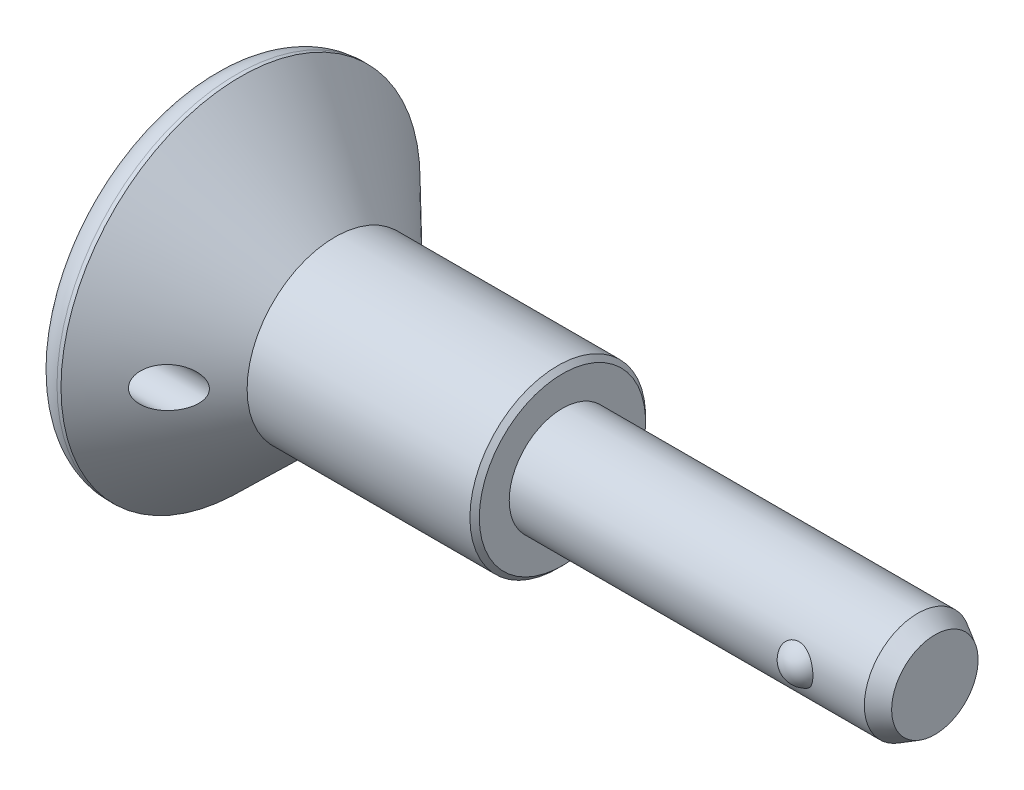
ISO-10303-21;
HEADER;
FILE_DESCRIPTION(('STEP AP214'),'2;1');
FILE_NAME('part.step','',(''),(''),'','','');
FILE_SCHEMA(('AUTOMOTIVE_DESIGN { 1 0 10303 214 1 1 1 1 }'));
ENDSEC;
DATA;
#1=APPLICATION_CONTEXT('core data for automotive mechanical design processes');
#2=APPLICATION_PROTOCOL_DEFINITION('international standard','automotive_design',2000,#1);
#3=PRODUCT_CONTEXT('',#1,'mechanical');
#4=PRODUCT('Part','Part','',(#3));
#5=PRODUCT_RELATED_PRODUCT_CATEGORY('part','',(#4));
#6=PRODUCT_DEFINITION_FORMATION('','',#4);
#7=PRODUCT_DEFINITION_CONTEXT('part definition',#1,'design');
#8=PRODUCT_DEFINITION('design','',#6,#7);
#9=PRODUCT_DEFINITION_SHAPE('','',#8);
#10=(LENGTH_UNIT() NAMED_UNIT(*) SI_UNIT(.MILLI.,.METRE.));
#11=(NAMED_UNIT(*) PLANE_ANGLE_UNIT() SI_UNIT($,.RADIAN.));
#12=(NAMED_UNIT(*) SI_UNIT($,.STERADIAN.) SOLID_ANGLE_UNIT());
#13=UNCERTAINTY_MEASURE_WITH_UNIT(LENGTH_MEASURE(1.E-05),#10,'distance_accuracy_value','');
#14=(GEOMETRIC_REPRESENTATION_CONTEXT(3) GLOBAL_UNCERTAINTY_ASSIGNED_CONTEXT((#13)) GLOBAL_UNIT_ASSIGNED_CONTEXT((#10,
#11,#12)) REPRESENTATION_CONTEXT('',''));
#15=CARTESIAN_POINT('',(0.,0.,0.));
#16=DIRECTION('',(0.,0.,1.));
#17=DIRECTION('',(1.,0.,0.));
#18=AXIS2_PLACEMENT_3D('',#15,#16,#17);
#19=CARTESIAN_POINT('',(26.5,0.,0.));
#20=DIRECTION('',(-1.,0.,0.));
#21=DIRECTION('',(0.,0.,1.));
#22=AXIS2_PLACEMENT_3D('',#19,#20,#21);
#23=PLANE('',#22);
#24=CARTESIAN_POINT('',(26.5,0.,0.));
#25=DIRECTION('',(-1.,0.,0.));
#26=DIRECTION('',(0.,0.,1.));
#27=AXIS2_PLACEMENT_3D('',#24,#25,#26);
#28=CIRCLE('',#27,6.25);
#29=CARTESIAN_POINT('',(26.5,0.,6.25));
#30=VERTEX_POINT('',#29);
#31=EDGE_CURVE('E156',#30,#30,#28,.T.);
#32=ORIENTED_EDGE('',*,*,#31,.F.);
#33=EDGE_LOOP('',(#32));
#34=FACE_BOUND('',#33,.T.);
#35=CARTESIAN_POINT('',(26.5,0.,0.));
#36=DIRECTION('',(-1.,0.,0.));
#37=DIRECTION('',(0.,0.,1.));
#38=AXIS2_PLACEMENT_3D('',#35,#36,#37);
#39=CIRCLE('',#38,4.);
#40=CARTESIAN_POINT('',(26.5,0.,4.));
#41=VERTEX_POINT('',#40);
#42=EDGE_CURVE('E11',#41,#41,#39,.F.);
#43=ORIENTED_EDGE('',*,*,#42,.F.);
#44=EDGE_LOOP('',(#43));
#45=FACE_BOUND('',#44,.T.);
#46=ADVANCED_FACE('F16',(#34,#45),#23,.F.);
#47=CARTESIAN_POINT('',(0.,0.,0.));
#48=DIRECTION('',(-1.,0.,0.));
#49=DIRECTION('',(0.,0.,1.));
#50=AXIS2_PLACEMENT_3D('',#47,#48,#49);
#51=PLANE('',#50);
#52=CARTESIAN_POINT('',(0.,0.,0.));
#53=DIRECTION('',(-1.,0.,0.));
#54=DIRECTION('',(0.,0.,1.));
#55=AXIS2_PLACEMENT_3D('',#52,#53,#54);
#56=CIRCLE('',#55,11.5);
#57=CARTESIAN_POINT('',(0.,0.,11.5));
#58=VERTEX_POINT('',#57);
#59=EDGE_CURVE('E160',#58,#58,#56,.T.);
#60=ORIENTED_EDGE('',*,*,#59,.T.);
#61=EDGE_LOOP('',(#60));
#62=FACE_BOUND('',#61,.T.);
#63=CARTESIAN_POINT('',(0.,0.,9.5));
#64=DIRECTION('',(-1.,0.,0.));
#65=DIRECTION('',(0.,0.,1.));
#66=AXIS2_PLACEMENT_3D('',#63,#64,#65);
#67=CIRCLE('',#66,1.5);
#68=CARTESIAN_POINT('',(0.,-1.44712916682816,9.89473684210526));
#69=VERTEX_POINT('',#68);
#70=CARTESIAN_POINT('',(0.,1.44712916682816,9.89473684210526));
#71=VERTEX_POINT('',#70);
#72=EDGE_CURVE('E48',#69,#71,#67,.T.);
#73=ORIENTED_EDGE('',*,*,#72,.F.);
#74=CARTESIAN_POINT('',(0.,0.,0.));
#75=DIRECTION('',(-1.,0.,0.));
#76=DIRECTION('',(0.,0.,1.));
#77=AXIS2_PLACEMENT_3D('',#74,#75,#76);
#78=CIRCLE('',#77,10.);
#79=EDGE_CURVE('E37',#71,#69,#78,.T.);
#80=ORIENTED_EDGE('',*,*,#79,.F.);
#81=EDGE_LOOP('',(#73,#80));
#82=FACE_BOUND('',#81,.T.);
#83=ADVANCED_FACE('F47',(#62,#82),#51,.T.);
#84=CARTESIAN_POINT('',(-1.,0.,9.5));
#85=DIRECTION('',(1.,0.,0.));
#86=DIRECTION('',(0.,-1.,0.));
#87=AXIS2_PLACEMENT_3D('',#84,#85,#86);
#88=CYLINDRICAL_SURFACE('',#87,1.5);
#89=CARTESIAN_POINT('',(5.04893948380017,-0.743081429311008,10.8030080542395));
#90=CARTESIAN_POINT('',(5.02077798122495,-0.688374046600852,10.8342033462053));
#91=CARTESIAN_POINT('',(4.99527839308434,-0.630616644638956,10.862568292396));
#92=CARTESIAN_POINT('',(4.95072736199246,-0.509716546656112,10.912254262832));
#93=CARTESIAN_POINT('',(4.93168139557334,-0.446569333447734,10.9335693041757));
#94=CARTESIAN_POINT('',(4.90103527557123,-0.315899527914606,10.9679201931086));
#95=CARTESIAN_POINT('',(4.8894758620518,-0.24835516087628,10.9809107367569));
#96=CARTESIAN_POINT('',(4.87475650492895,-0.111242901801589,10.9974594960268));
#97=CARTESIAN_POINT('',(4.87159053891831,-0.0416764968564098,11.0010244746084));
#98=CARTESIAN_POINT('',(4.8737861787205,0.0921915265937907,10.9985541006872));
#99=CARTESIAN_POINT('',(4.8785594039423,0.15651689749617,10.9931811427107));
#100=CARTESIAN_POINT('',(4.8952322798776,0.283031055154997,10.9744437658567));
#101=CARTESIAN_POINT('',(4.90713279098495,0.345219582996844,10.9610783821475));
#102=CARTESIAN_POINT('',(4.937416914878,0.466033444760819,10.9271509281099));
#103=CARTESIAN_POINT('',(4.95581197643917,0.524652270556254,10.9065761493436));
#104=CARTESIAN_POINT('',(4.99820556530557,0.637182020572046,10.8593126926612));
#105=CARTESIAN_POINT('',(5.02220667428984,0.691090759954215,10.8326211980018));
#106=CARTESIAN_POINT('',(5.08564757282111,0.814473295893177,10.7623448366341));
#107=CARTESIAN_POINT('',(5.12739722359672,0.881366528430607,10.7163033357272));
#108=CARTESIAN_POINT('',(5.21796830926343,1.00417870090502,10.6170888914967));
#109=CARTESIAN_POINT('',(5.26680344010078,1.06007588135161,10.5639021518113));
#110=CARTESIAN_POINT('',(5.38708699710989,1.17811273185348,10.4338844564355));
#111=CARTESIAN_POINT('',(5.4606097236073,1.23600725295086,10.3551260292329));
#112=CARTESIAN_POINT('',(5.61388931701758,1.33381990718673,10.1927720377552));
#113=CARTESIAN_POINT('',(5.69365466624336,1.37371306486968,10.1091699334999));
#114=CARTESIAN_POINT('',(5.88225404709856,1.4465937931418,9.91388012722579));
#115=CARTESIAN_POINT('',(5.9925282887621,1.47375522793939,9.8014099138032));
#116=CARTESIAN_POINT('',(6.21659489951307,1.50231947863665,9.57671622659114));
#117=CARTESIAN_POINT('',(6.33039113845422,1.50369287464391,9.46449318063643));
#118=CARTESIAN_POINT('',(6.56028424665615,1.48188892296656,9.24173191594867));
#119=CARTESIAN_POINT('',(6.67639134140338,1.45837695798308,9.13123745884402));
#120=CARTESIAN_POINT('',(6.90643421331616,1.38640022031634,8.91626960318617));
#121=CARTESIAN_POINT('',(7.02037191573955,1.33795875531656,8.81179068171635));
#122=CARTESIAN_POINT('',(7.21050009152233,1.23221897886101,8.64053335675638));
#123=CARTESIAN_POINT('',(7.28822257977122,1.18134100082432,8.57147360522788));
#124=CARTESIAN_POINT('',(7.43809723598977,1.06488380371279,8.43994042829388));
#125=CARTESIAN_POINT('',(7.51025846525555,0.999329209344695,8.37745622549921));
#126=CARTESIAN_POINT('',(7.62440104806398,0.874693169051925,8.27970971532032));
#127=CARTESIAN_POINT('',(7.66884300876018,0.819811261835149,8.24198211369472));
#128=CARTESIAN_POINT('',(7.75116410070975,0.701855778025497,8.17257218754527));
#129=CARTESIAN_POINT('',(7.78905330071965,0.638795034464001,8.14088058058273));
#130=CARTESIAN_POINT('',(7.84781829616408,0.520195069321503,8.09198637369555));
#131=CARTESIAN_POINT('',(7.87060209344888,0.466295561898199,8.07312800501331));
#132=CARTESIAN_POINT('',(7.90916133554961,0.354377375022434,8.04130516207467));
#133=CARTESIAN_POINT('',(7.92494314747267,0.29636249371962,8.02833533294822));
#134=CARTESIAN_POINT('',(7.94819747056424,0.177034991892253,8.00925096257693));
#135=CARTESIAN_POINT('',(7.95560071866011,0.115699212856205,8.00319356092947));
#136=CARTESIAN_POINT('',(7.96102625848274,-0.00765741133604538,7.99875257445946));
#137=CARTESIAN_POINT('',(7.95905297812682,-0.0696779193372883,8.00036536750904));
#138=CARTESIAN_POINT('',(7.94678999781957,-0.18447139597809,8.01041020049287));
#139=CARTESIAN_POINT('',(7.93755628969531,-0.237441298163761,8.01797643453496));
#140=CARTESIAN_POINT('',(7.91283968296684,-0.340850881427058,8.03828815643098));
#141=CARTESIAN_POINT('',(7.89735392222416,-0.391289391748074,8.05103601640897));
#142=CARTESIAN_POINT('',(7.85444035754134,-0.506844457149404,8.08649833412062));
#143=CARTESIAN_POINT('',(7.82471445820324,-0.570507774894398,8.11115474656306));
#144=CARTESIAN_POINT('',(7.75797917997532,-0.690811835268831,8.16688402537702));
#145=CARTESIAN_POINT('',(7.72095420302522,-0.747437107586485,8.19797064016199));
#146=CARTESIAN_POINT('',(7.62345524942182,-0.878148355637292,8.28046003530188));
#147=CARTESIAN_POINT('',(7.56003258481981,-0.948273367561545,8.33462769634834));
#148=CARTESIAN_POINT('',(7.42645542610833,-1.07476958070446,8.45013026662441));
#149=CARTESIAN_POINT('',(7.35628757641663,-1.13111267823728,8.51147944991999));
#150=CARTESIAN_POINT('',(7.18051046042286,-1.25296314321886,8.66713887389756));
#151=CARTESIAN_POINT('',(7.07273498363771,-1.31183707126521,8.76419965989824));
#152=CARTESIAN_POINT('',(6.85351984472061,-1.40585361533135,8.96530542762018));
#153=CARTESIAN_POINT('',(6.7420764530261,-1.44097124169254,9.06935763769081));
#154=CARTESIAN_POINT('',(6.51602642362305,-1.48855878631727,9.2842219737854));
#155=CARTESIAN_POINT('',(6.40140432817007,-1.50051076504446,9.39513269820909));
#156=CARTESIAN_POINT('',(6.17418690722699,-1.4994566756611,9.61884504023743));
#157=CARTESIAN_POINT('',(6.06158988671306,-1.48647256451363,9.73164490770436));
#158=CARTESIAN_POINT('',(5.86104301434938,-1.43841086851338,9.93579800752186));
#159=CARTESIAN_POINT('',(5.77228415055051,-1.40769567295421,10.0273818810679));
#160=CARTESIAN_POINT('',(5.60021944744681,-1.32654908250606,10.2070838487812));
#161=CARTESIAN_POINT('',(5.51691012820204,-1.27613041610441,10.2952041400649));
#162=CARTESIAN_POINT('',(5.37856732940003,-1.16906426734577,10.4430967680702));
#163=CARTESIAN_POINT('',(5.3216495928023,-1.11707274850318,10.5044745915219));
#164=CARTESIAN_POINT('',(5.21469929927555,-1.00046945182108,10.6206172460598));
#165=CARTESIAN_POINT('',(5.16464057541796,-0.935908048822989,10.6754071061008));
#166=CARTESIAN_POINT('',(5.0943253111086,-0.826282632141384,10.7528043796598));
#167=CARTESIAN_POINT('',(5.07082832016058,-0.785603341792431,10.7787611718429));
#168=CARTESIAN_POINT('',(5.04893948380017,-0.743081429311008,10.8030080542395));
#169=B_SPLINE_CURVE_WITH_KNOTS('',3,(#89,#90,#91,#92,#93,#94,#95,#96,#97,#98,#99,#100,#101,#102,
#103,#104,#105,#106,#107,#108,#109,#110,#111,#112,#113,#114,#115,#116,#117,#118,#119,#120,#121,
#122,#123,#124,#125,#126,#127,#128,#129,#130,#131,#132,#133,#134,#135,#136,#137,#138,#139,#140,
#141,#142,#143,#144,#145,#146,#147,#148,#149,#150,#151,#152,#153,#154,#155,#156,#157,#158,#159,
#160,#161,#162,#163,#164,#165,#166,#167,#168),.UNSPECIFIED.,.T.,.F.,(4,2,2,2,2,2,2,2,2,2,2,2,2,
2,2,2,2,2,2,2,2,2,2,2,2,2,2,2,2,2,2,2,2,2,2,2,2,2,2,4),(0.,0.206827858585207,0.413830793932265,
0.62195093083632,0.829921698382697,1.0231553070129,1.21641224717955,1.41001158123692,
1.60370024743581,1.87612170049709,2.14907692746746,2.51402398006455,2.87947582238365,
3.35649420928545,3.83405676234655,4.3181233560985,4.80173819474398,5.1480344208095,
5.49375392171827,5.73325221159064,5.97237916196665,6.15613300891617,6.33971941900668,
6.52481264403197,6.70981847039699,6.87200093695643,7.03425773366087,7.25639936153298,
7.47902095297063,7.80411901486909,8.12987458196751,8.59699308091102,9.06460218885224,
9.54255074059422,10.0200786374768,10.4122784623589,10.8042253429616,11.0988406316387,
11.3922986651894,11.5530578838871),.UNSPECIFIED.);
#170=CARTESIAN_POINT('',(5.04893948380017,-0.743081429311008,10.8030080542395));
#171=VERTEX_POINT('',#170);
#172=EDGE_CURVE('E54',#171,#171,#169,.T.);
#173=ORIENTED_EDGE('',*,*,#172,.F.);
#174=EDGE_LOOP('',(#173));
#175=FACE_BOUND('',#174,.T.);
#176=CARTESIAN_POINT('',(-1.99999999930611E-06,-1.44712874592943,9.89473838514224));
#177=CARTESIAN_POINT('',(0.0833519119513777,-1.46463068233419,9.83043715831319));
#178=CARTESIAN_POINT('',(0.166879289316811,-1.47786277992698,9.76518204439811));
#179=CARTESIAN_POINT('',(0.333869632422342,-1.49557590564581,9.63314256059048));
#180=CARTESIAN_POINT('',(0.417332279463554,-1.50004285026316,9.56635590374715));
#181=CARTESIAN_POINT('',(0.584420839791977,-1.49995613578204,9.43110468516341));
#182=CARTESIAN_POINT('',(0.668038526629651,-1.49530312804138,9.36262975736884));
#183=CARTESIAN_POINT('',(0.833813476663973,-1.47627385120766,9.2253869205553));
#184=CARTESIAN_POINT('',(0.915971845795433,-1.46190529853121,9.15661928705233));
#185=CARTESIAN_POINT('',(1.1017504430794,-1.41704524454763,8.99953318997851));
#186=CARTESIAN_POINT('',(1.20467209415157,-1.38308262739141,8.91133843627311));
#187=CARTESIAN_POINT('',(1.40443927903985,-1.29574539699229,8.73815034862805));
#188=CARTESIAN_POINT('',(1.50130514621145,-1.24244034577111,8.65314673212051));
#189=CARTESIAN_POINT('',(1.65892361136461,-1.13234357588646,8.51346528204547));
#190=CARTESIAN_POINT('',(1.72201451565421,-1.08102554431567,8.45713054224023));
#191=CARTESIAN_POINT('',(1.84140074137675,-0.966123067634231,8.34988459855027));
#192=CARTESIAN_POINT('',(1.89770421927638,-0.902553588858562,8.29896689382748));
#193=CARTESIAN_POINT('',(1.9873420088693,-0.780480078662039,8.21751481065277));
#194=CARTESIAN_POINT('',(2.02286540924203,-0.724850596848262,8.18510032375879));
#195=CARTESIAN_POINT('',(2.08684254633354,-0.6066202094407,8.12655715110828));
#196=CARTESIAN_POINT('',(2.11530559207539,-0.544028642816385,8.10042018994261));
#197=CARTESIAN_POINT('',(2.1592670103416,-0.423842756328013,8.05997419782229));
#198=CARTESIAN_POINT('',(2.17614042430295,-0.367176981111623,8.04441547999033));
#199=CARTESIAN_POINT('',(2.20267886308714,-0.250792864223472,8.01992219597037));
#200=CARTESIAN_POINT('',(2.21234848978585,-0.191076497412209,8.01098340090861));
#201=CARTESIAN_POINT('',(2.22379605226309,-0.0700107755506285,8.00039928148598));
#202=CARTESIAN_POINT('',(2.22554467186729,-0.00865619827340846,7.99878105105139));
#203=CARTESIAN_POINT('',(2.22092802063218,0.113480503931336,8.00305086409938));
#204=CARTESIAN_POINT('',(2.21456224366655,0.174262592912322,8.00893937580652));
#205=CARTESIAN_POINT('',(2.1947979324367,0.289985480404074,8.02719746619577));
#206=CARTESIAN_POINT('',(2.18181973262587,0.345061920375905,8.03917961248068));
#207=CARTESIAN_POINT('',(2.14988163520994,0.451893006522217,8.06861312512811));
#208=CARTESIAN_POINT('',(2.1309194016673,0.503646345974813,8.08606662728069));
#209=CARTESIAN_POINT('',(2.07954634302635,0.622490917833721,8.13324166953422));
#210=CARTESIAN_POINT('',(2.04477346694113,0.687715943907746,8.16509432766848));
#211=CARTESIAN_POINT('',(1.96777081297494,0.809689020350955,8.23533292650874));
#212=CARTESIAN_POINT('',(1.92552600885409,0.866419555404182,8.27373202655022));
#213=CARTESIAN_POINT('',(1.81685679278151,0.993223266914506,8.3720193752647));
#214=CARTESIAN_POINT('',(1.74765993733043,1.0591052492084,8.43422523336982));
#215=CARTESIAN_POINT('',(1.60194878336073,1.17548713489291,8.56412621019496));
#216=CARTESIAN_POINT('',(1.52542198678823,1.22596012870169,8.63183067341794));
#217=CARTESIAN_POINT('',(1.38856936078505,1.30144524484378,8.75178350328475));
#218=CARTESIAN_POINT('',(1.32936025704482,1.32965803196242,8.80334308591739));
#219=CARTESIAN_POINT('',(1.20894530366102,1.37920320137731,8.90744365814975));
#220=CARTESIAN_POINT('',(1.14773852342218,1.40053232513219,8.95998510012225));
#221=CARTESIAN_POINT('',(0.961661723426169,1.45497522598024,9.11848108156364));
#222=CARTESIAN_POINT('',(0.834484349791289,1.47846624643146,9.22517614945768));
#223=CARTESIAN_POINT('',(0.647587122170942,1.49591827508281,9.37929750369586));
#224=CARTESIAN_POINT('',(0.588933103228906,1.4989987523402,9.42728983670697));
#225=CARTESIAN_POINT('',(0.471193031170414,1.50058695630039,9.52285460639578));
#226=CARTESIAN_POINT('',(0.412106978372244,1.49909468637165,9.57042704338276));
#227=CARTESIAN_POINT('',(0.294172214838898,1.49168569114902,9.66458960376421));
#228=CARTESIAN_POINT('',(0.235325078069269,1.4858024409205,9.71118443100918));
#229=CARTESIAN_POINT('',(0.117622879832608,1.46970236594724,9.80358866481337));
#230=CARTESIAN_POINT('',(0.0587678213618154,1.45948627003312,9.84939820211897));
#231=CARTESIAN_POINT('',(-1.9999999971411E-06,1.44712874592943,9.89473838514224));
#232=B_SPLINE_CURVE_WITH_KNOTS('',3,(#176,#177,#178,#179,#180,#181,#182,#183,#184,#185,#186,
#187,#188,#189,#190,#191,#192,#193,#194,#195,#196,#197,#198,#199,#200,#201,#202,#203,#204,#205,
#206,#207,#208,#209,#210,#211,#212,#213,#214,#215,#216,#217,#218,#219,#220,#221,#222,#223,#224,
#225,#226,#227,#228,#229,#230,#231),.UNSPECIFIED.,.F.,.F.,(4,2,2,2,2,2,2,2,2,2,2,2,2,2,2,2,2,2,
2,2,2,2,2,2,2,2,2,4),(0.,0.320079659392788,0.640673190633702,0.964778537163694,1.28862677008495,
1.70655145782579,2.12298780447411,2.41890478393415,2.71446253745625,2.93430144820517,
3.15384894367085,3.33649195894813,3.51901819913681,3.70221943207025,3.88543209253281,
4.05823032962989,4.2310961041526,4.47121553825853,4.71182346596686,5.05198338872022,
5.39273399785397,5.64268596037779,5.89275607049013,6.39352928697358,6.62099234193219,
6.84845522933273,7.07420152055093,7.29990985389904),.UNSPECIFIED.);
#233=EDGE_CURVE('E30',#69,#71,#232,.T.);
#234=ORIENTED_EDGE('',*,*,#233,.F.);
#235=ORIENTED_EDGE('',*,*,#72,.T.);
#236=EDGE_LOOP('',(#234,#235));
#237=FACE_BOUND('',#236,.T.);
#238=ADVANCED_FACE('F52',(#175,#237),#88,.F.);
#239=CARTESIAN_POINT('',(0.,0.,0.));
#240=DIRECTION('',(-1.,0.,0.));
#241=DIRECTION('',(0.,0.,1.));
#242=AXIS2_PLACEMENT_3D('',#239,#240,#241);
#243=CYLINDRICAL_SURFACE('',#242,6.60355339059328);
#244=CARTESIAN_POINT('',(9.39644660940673,0.,0.));
#245=DIRECTION('',(-1.,0.,0.));
#246=DIRECTION('',(0.,0.,1.));
#247=AXIS2_PLACEMENT_3D('',#244,#245,#246);
#248=CIRCLE('',#247,6.60355339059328);
#249=CARTESIAN_POINT('',(9.39644660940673,0.,6.60355339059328));
#250=VERTEX_POINT('',#249);
#251=EDGE_CURVE('E44',#250,#250,#248,.T.);
#252=ORIENTED_EDGE('',*,*,#251,.F.);
#253=EDGE_LOOP('',(#252));
#254=FACE_BOUND('',#253,.T.);
#255=CARTESIAN_POINT('',(26.1464466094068,0.,0.));
#256=DIRECTION('',(-1.,0.,0.));
#257=DIRECTION('',(0.,0.,1.));
#258=AXIS2_PLACEMENT_3D('',#255,#256,#257);
#259=CIRCLE('',#258,6.60355339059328);
#260=CARTESIAN_POINT('',(26.1464466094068,0.,6.60355339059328));
#261=VERTEX_POINT('',#260);
#262=EDGE_CURVE('E61',#261,#261,#259,.T.);
#263=ORIENTED_EDGE('',*,*,#262,.T.);
#264=EDGE_LOOP('',(#263));
#265=FACE_BOUND('',#264,.T.);
#266=ADVANCED_FACE('F18',(#254,#265),#243,.T.);
#267=CARTESIAN_POINT('',(9.39644660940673,0.,0.));
#268=DIRECTION('',(-1.,0.,0.));
#269=DIRECTION('',(0.,0.,1.));
#270=AXIS2_PLACEMENT_3D('',#267,#268,#269);
#271=CONICAL_SURFACE('',#270,6.60355339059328,0.771106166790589);
#272=ORIENTED_EDGE('',*,*,#172,.T.);
#273=EDGE_LOOP('',(#272));
#274=FACE_BOUND('',#273,.T.);
#275=CARTESIAN_POINT('',(2.3,0.,0.));
#276=DIRECTION('',(-1.,0.,0.));
#277=DIRECTION('',(0.,0.,1.));
#278=AXIS2_PLACEMENT_3D('',#275,#276,#277);
#279=CIRCLE('',#278,13.5);
#280=CARTESIAN_POINT('',(2.3,0.,13.5));
#281=VERTEX_POINT('',#280);
#282=EDGE_CURVE('E166',#281,#281,#279,.T.);
#283=ORIENTED_EDGE('',*,*,#282,.F.);
#284=EDGE_LOOP('',(#283));
#285=FACE_BOUND('',#284,.T.);
#286=ORIENTED_EDGE('',*,*,#251,.T.);
#287=EDGE_LOOP('',(#286));
#288=FACE_BOUND('',#287,.T.);
#289=ADVANCED_FACE('F144',(#274,#285,#288),#271,.T.);
#290=CARTESIAN_POINT('',(0.,0.,0.));
#291=DIRECTION('',(-1.,0.,0.));
#292=DIRECTION('',(0.,0.,1.));
#293=AXIS2_PLACEMENT_3D('',#290,#291,#292);
#294=CYLINDRICAL_SURFACE('',#293,13.5);
#295=CARTESIAN_POINT('',(2.,0.,0.));
#296=DIRECTION('',(-1.,0.,0.));
#297=DIRECTION('',(0.,0.,1.));
#298=AXIS2_PLACEMENT_3D('',#295,#296,#297);
#299=CIRCLE('',#298,13.5);
#300=CARTESIAN_POINT('',(2.,0.,13.5));
#301=VERTEX_POINT('',#300);
#302=EDGE_CURVE('E163',#301,#301,#299,.T.);
#303=ORIENTED_EDGE('',*,*,#302,.F.);
#304=EDGE_LOOP('',(#303));
#305=FACE_BOUND('',#304,.T.);
#306=ORIENTED_EDGE('',*,*,#282,.T.);
#307=EDGE_LOOP('',(#306));
#308=FACE_BOUND('',#307,.T.);
#309=ADVANCED_FACE('F141',(#305,#308),#294,.T.);
#310=CARTESIAN_POINT('',(2.,0.,0.));
#311=DIRECTION('',(-1.,0.,0.));
#312=DIRECTION('',(0.,0.,1.));
#313=AXIS2_PLACEMENT_3D('',#310,#311,#312);
#314=TOROIDAL_SURFACE('',#313,11.5,2.);
#315=ORIENTED_EDGE('',*,*,#59,.F.);
#316=EDGE_LOOP('',(#315));
#317=FACE_BOUND('',#316,.T.);
#318=ORIENTED_EDGE('',*,*,#302,.T.);
#319=EDGE_LOOP('',(#318));
#320=FACE_BOUND('',#319,.T.);
#321=ADVANCED_FACE('F138',(#317,#320),#314,.T.);
#322=CARTESIAN_POINT('',(26.5,0.,0.));
#323=DIRECTION('',(-1.,0.,0.));
#324=DIRECTION('',(0.,0.,1.));
#325=AXIS2_PLACEMENT_3D('',#322,#323,#324);
#326=CONICAL_SURFACE('',#325,6.25,0.78539816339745);
#327=ORIENTED_EDGE('',*,*,#262,.F.);
#328=EDGE_LOOP('',(#327));
#329=FACE_BOUND('',#328,.T.);
#330=ORIENTED_EDGE('',*,*,#31,.T.);
#331=EDGE_LOOP('',(#330));
#332=FACE_BOUND('',#331,.T.);
#333=ADVANCED_FACE('F76',(#329,#332),#326,.T.);
#334=CARTESIAN_POINT('',(-8.86738091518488,0.,0.));
#335=DIRECTION('',(-1.,0.,0.));
#336=DIRECTION('',(0.,0.,1.));
#337=AXIS2_PLACEMENT_3D('',#334,#335,#336);
#338=DEGENERATE_TOROIDAL_SURFACE('',#337,2.09832863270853,15.,.F.);
#339=CARTESIAN_POINT('',(4.4,0.,0.));
#340=DIRECTION('',(-1.,0.,0.));
#341=DIRECTION('',(0.,0.,1.));
#342=AXIS2_PLACEMENT_3D('',#339,#340,#341);
#343=CIRCLE('',#342,4.9);
#344=CARTESIAN_POINT('',(4.4,0.,4.9));
#345=VERTEX_POINT('',#344);
#346=EDGE_CURVE('E50',#345,#345,#343,.T.);
#347=ORIENTED_EDGE('',*,*,#346,.F.);
#348=EDGE_LOOP('',(#347));
#349=FACE_BOUND('',#348,.T.);
#350=ORIENTED_EDGE('',*,*,#233,.T.);
#351=ORIENTED_EDGE('',*,*,#79,.T.);
#352=EDGE_LOOP('',(#350,#351));
#353=FACE_BOUND('',#352,.T.);
#354=ADVANCED_FACE('F39',(#349,#353),#338,.T.);
#355=CARTESIAN_POINT('',(0.5,0.,0.));
#356=DIRECTION('',(-1.,0.,0.));
#357=DIRECTION('',(0.,0.,1.));
#358=AXIS2_PLACEMENT_3D('',#355,#356,#357);
#359=PLANE('',#358);
#360=CARTESIAN_POINT('',(0.5,0.,0.));
#361=DIRECTION('',(1.,0.,0.));
#362=DIRECTION('',(0.,1.,0.));
#363=AXIS2_PLACEMENT_3D('',#360,#361,#362);
#364=CIRCLE('',#363,4.9);
#365=CARTESIAN_POINT('',(0.5,4.9,0.));
#366=VERTEX_POINT('',#365);
#367=EDGE_CURVE('E248',#366,#366,#364,.T.);
#368=ORIENTED_EDGE('',*,*,#367,.F.);
#369=EDGE_LOOP('',(#368));
#370=FACE_BOUND('',#369,.T.);
#371=ADVANCED_FACE('F75',(#370),#359,.T.);
#372=CARTESIAN_POINT('',(9.4,0.,0.));
#373=DIRECTION('',(-1.,0.,0.));
#374=DIRECTION('',(0.,1.,0.));
#375=AXIS2_PLACEMENT_3D('',#372,#373,#374);
#376=CYLINDRICAL_SURFACE('',#375,4.9);
#377=ORIENTED_EDGE('',*,*,#346,.T.);
#378=EDGE_LOOP('',(#377));
#379=FACE_BOUND('',#378,.T.);
#380=ORIENTED_EDGE('',*,*,#367,.T.);
#381=EDGE_LOOP('',(#380));
#382=FACE_BOUND('',#381,.T.);
#383=ADVANCED_FACE('F78',(#379,#382),#376,.T.);
#384=CARTESIAN_POINT('',(25.5,0.,0.));
#385=DIRECTION('',(-1.,0.,0.));
#386=DIRECTION('',(0.,0.,1.));
#387=AXIS2_PLACEMENT_3D('',#384,#385,#386);
#388=CYLINDRICAL_SURFACE('',#387,4.);
#389=CARTESIAN_POINT('',(48.02,1.43396296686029,-3.73413312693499));
#390=CARTESIAN_POINT('',(47.9515616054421,1.43396484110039,-3.73413174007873));
#391=CARTESIAN_POINT('',(47.8831344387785,1.42827892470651,-3.73633060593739));
#392=CARTESIAN_POINT('',(47.748405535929,1.40579107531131,-3.74484892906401));
#393=CARTESIAN_POINT('',(47.6821038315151,1.38898897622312,-3.75116844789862));
#394=CARTESIAN_POINT('',(47.5536860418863,1.34501817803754,-3.76715616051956));
#395=CARTESIAN_POINT('',(47.4915595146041,1.31787656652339,-3.77681559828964));
#396=CARTESIAN_POINT('',(47.3727725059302,1.25420979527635,-3.79843170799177));
#397=CARTESIAN_POINT('',(47.3161131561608,1.21768269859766,-3.81038885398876));
#398=CARTESIAN_POINT('',(47.2073874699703,1.13489188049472,-3.8358778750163));
#399=CARTESIAN_POINT('',(47.1555668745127,1.08831932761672,-3.84945150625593));
#400=CARTESIAN_POINT('',(47.0598058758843,0.987664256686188,-3.87649776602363));
#401=CARTESIAN_POINT('',(47.0158677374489,0.933579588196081,-3.88997036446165));
#402=CARTESIAN_POINT('',(46.9327025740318,0.813890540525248,-3.91684568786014));
#403=CARTESIAN_POINT('',(46.894304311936,0.747681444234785,-3.93012326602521));
#404=CARTESIAN_POINT('',(46.8280843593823,0.609702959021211,-3.95388000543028));
#405=CARTESIAN_POINT('',(46.800266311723,0.537931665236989,-3.96435820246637));
#406=CARTESIAN_POINT('',(46.7540966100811,0.385994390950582,-3.98211154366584));
#407=CARTESIAN_POINT('',(46.7364515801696,0.305584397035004,-3.98914336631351));
#408=CARTESIAN_POINT('',(46.7136505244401,0.142737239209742,-3.99828473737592));
#409=CARTESIAN_POINT('',(46.7084964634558,0.0602997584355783,-4.00039351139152));
#410=CARTESIAN_POINT('',(46.7107611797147,-0.106351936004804,-3.99947416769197));
#411=CARTESIAN_POINT('',(46.7184831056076,-0.190561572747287,-3.9963221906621));
#412=CARTESIAN_POINT('',(46.7469986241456,-0.356394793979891,-3.98495832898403));
#413=CARTESIAN_POINT('',(46.7677931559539,-0.438018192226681,-3.97674608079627));
#414=CARTESIAN_POINT('',(46.8222110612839,-0.596303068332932,-3.95610835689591));
#415=CARTESIAN_POINT('',(46.8558325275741,-0.672965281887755,-3.94368350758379));
#416=CARTESIAN_POINT('',(46.9354777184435,-0.819009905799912,-3.91596088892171));
#417=CARTESIAN_POINT('',(46.9815014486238,-0.88839231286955,-3.90066311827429));
#418=CARTESIAN_POINT('',(47.0838406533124,-1.01582784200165,-3.86940434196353));
#419=CARTESIAN_POINT('',(47.139849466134,-1.07413343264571,-3.85347184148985));
#420=CARTESIAN_POINT('',(47.2618430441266,-1.17950092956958,-3.82253833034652));
#421=CARTESIAN_POINT('',(47.327822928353,-1.22656830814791,-3.8075368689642));
#422=CARTESIAN_POINT('',(47.462861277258,-1.30444945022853,-3.78153141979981));
#423=CARTESIAN_POINT('',(47.5313330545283,-1.3362064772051,-3.77031410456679));
#424=CARTESIAN_POINT('',(47.6733673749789,-1.38692730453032,-3.75195565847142));
#425=CARTESIAN_POINT('',(47.7469257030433,-1.40590156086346,-3.74481119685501));
#426=CARTESIAN_POINT('',(47.8892370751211,-1.4289465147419,-3.7360736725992));
#427=CARTESIAN_POINT('',(47.9577562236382,-1.43429361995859,-3.73400589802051));
#428=CARTESIAN_POINT('',(48.0947191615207,-1.43360094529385,-3.73427240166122));
#429=CARTESIAN_POINT('',(48.1631629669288,-1.4275644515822,-3.7366054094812));
#430=CARTESIAN_POINT('',(48.2947056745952,-1.40491857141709,-3.7451751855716));
#431=CARTESIAN_POINT('',(48.35790510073,-1.38881411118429,-3.75122529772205));
#432=CARTESIAN_POINT('',(48.4806847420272,-1.34710960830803,-3.76640208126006));
#433=CARTESIAN_POINT('',(48.5402645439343,-1.32150848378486,-3.77552910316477));
#434=CARTESIAN_POINT('',(48.6567059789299,-1.26050005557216,-3.79634206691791));
#435=CARTESIAN_POINT('',(48.7133724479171,-1.22475080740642,-3.80811355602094));
#436=CARTESIAN_POINT('',(48.8202988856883,-1.14503962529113,-3.83283489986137));
#437=CARTESIAN_POINT('',(48.8705566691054,-1.10107490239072,-3.84578515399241));
#438=CARTESIAN_POINT('',(48.9680613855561,-1.00187526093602,-3.87286878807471));
#439=CARTESIAN_POINT('',(49.0146409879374,-0.945985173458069,-3.88700476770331));
#440=CARTESIAN_POINT('',(49.0986329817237,-0.827415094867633,-3.91396001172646));
#441=CARTESIAN_POINT('',(49.1360419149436,-0.764732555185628,-3.92677877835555));
#442=CARTESIAN_POINT('',(49.2039673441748,-0.628712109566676,-3.95093286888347));
#443=CARTESIAN_POINT('',(49.2336547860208,-0.554921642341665,-3.96205695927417));
#444=CARTESIAN_POINT('',(49.2814260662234,-0.403209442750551,-3.98035985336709));
#445=CARTESIAN_POINT('',(49.2995070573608,-0.325286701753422,-3.98753768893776));
#446=CARTESIAN_POINT('',(49.3244078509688,-0.163868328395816,-3.99749448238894));
#447=CARTESIAN_POINT('',(49.3307000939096,-0.0802780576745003,-4.00006714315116));
#448=CARTESIAN_POINT('',(49.3303616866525,0.0868760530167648,-3.99993013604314));
#449=CARTESIAN_POINT('',(49.3237296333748,0.170439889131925,-3.99721989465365));
#450=CARTESIAN_POINT('',(49.2974652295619,0.33614293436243,-3.98672491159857));
#451=CARTESIAN_POINT('',(49.2776882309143,0.418255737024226,-3.97888372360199));
#452=CARTESIAN_POINT('',(49.2252136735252,0.577702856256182,-3.95887833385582));
#453=CARTESIAN_POINT('',(49.1925154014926,0.655036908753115,-3.94671389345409));
#454=CARTESIAN_POINT('',(49.1150116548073,0.801823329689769,-3.91951510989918));
#455=CARTESIAN_POINT('',(49.0703313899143,0.871347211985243,-3.90451089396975));
#456=CARTESIAN_POINT('',(48.9693922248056,1.00112870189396,-3.87326732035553));
#457=CARTESIAN_POINT('',(48.9131351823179,1.06138779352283,-3.85702816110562));
#458=CARTESIAN_POINT('',(48.7930286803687,1.16783984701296,-3.82610597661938));
#459=CARTESIAN_POINT('',(48.7296558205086,1.21455784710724,-3.81138569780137));
#460=CARTESIAN_POINT('',(48.5949254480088,1.295618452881,-3.78460106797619));
#461=CARTESIAN_POINT('',(48.5235737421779,1.32996998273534,-3.77253480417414));
#462=CARTESIAN_POINT('',(48.3811048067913,1.38247041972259,-3.75359776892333));
#463=CARTESIAN_POINT('',(48.3104327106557,1.40170257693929,-3.74638648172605));
#464=CARTESIAN_POINT('',(48.1665018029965,1.42744426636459,-3.73665622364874));
#465=CARTESIAN_POINT('',(48.0932444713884,1.43396096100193,-3.73413461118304));
#466=CARTESIAN_POINT('',(48.02,1.43396296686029,-3.73413312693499));
#467=B_SPLINE_CURVE_WITH_KNOTS('',3,(#389,#390,#391,#392,#393,#394,#395,#396,#397,#398,#399,
#400,#401,#402,#403,#404,#405,#406,#407,#408,#409,#410,#411,#412,#413,#414,#415,#416,#417,#418,
#419,#420,#421,#422,#423,#424,#425,#426,#427,#428,#429,#430,#431,#432,#433,#434,#435,#436,#437,
#438,#439,#440,#441,#442,#443,#444,#445,#446,#447,#448,#449,#450,#451,#452,#453,#454,#455,#456,
#457,#458,#459,#460,#461,#462,#463,#464,#465,#466),.UNSPECIFIED.,.T.,.F.,(4,2,2,2,2,2,2,2,2,2,2,
2,2,2,2,2,2,2,2,2,2,2,2,2,2,2,2,2,2,2,2,2,2,2,2,2,2,2,4),(0.,0.20503154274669,0.41006614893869,
0.614567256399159,0.819110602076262,1.03118085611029,1.24331194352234,1.47534540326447,
1.70745868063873,1.95419207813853,2.20096428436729,2.45362883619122,2.70631154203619,
2.9589566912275,3.21160195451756,3.4575201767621,3.70331840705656,3.93097418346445,
4.15844351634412,4.36365973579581,4.56881672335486,4.76442959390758,4.96006475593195,
5.1632907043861,5.36658576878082,5.58799572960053,5.80948905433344,6.04935401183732,
6.28927778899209,6.53970335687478,6.79015611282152,7.04341153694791,7.29668094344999,
7.54740043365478,7.79807972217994,8.03706510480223,8.27587767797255,8.49543123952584,
8.7148610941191),.UNSPECIFIED.);
#468=CARTESIAN_POINT('',(48.02,1.43396296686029,-3.73413312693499));
#469=VERTEX_POINT('',#468);
#470=EDGE_CURVE('E20',#469,#469,#467,.T.);
#471=ORIENTED_EDGE('',*,*,#470,.T.);
#472=EDGE_LOOP('',(#471));
#473=FACE_BOUND('',#472,.T.);
#474=CARTESIAN_POINT('',(48.02,1.43396296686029,3.73413312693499));
#475=CARTESIAN_POINT('',(48.0884383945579,1.43396484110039,3.73413174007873));
#476=CARTESIAN_POINT('',(48.1568655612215,1.42827892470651,3.73633060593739));
#477=CARTESIAN_POINT('',(48.291594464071,1.40579107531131,3.74484892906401));
#478=CARTESIAN_POINT('',(48.3578961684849,1.38898897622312,3.75116844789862));
#479=CARTESIAN_POINT('',(48.4863139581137,1.34501817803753,3.76715616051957));
#480=CARTESIAN_POINT('',(48.5484404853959,1.31787656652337,3.77681559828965));
#481=CARTESIAN_POINT('',(48.6672274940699,1.25420979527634,3.79843170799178));
#482=CARTESIAN_POINT('',(48.7238868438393,1.21768269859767,3.81038885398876));
#483=CARTESIAN_POINT('',(48.8326125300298,1.13489188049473,3.8358778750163));
#484=CARTESIAN_POINT('',(48.8844331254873,1.0883193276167,3.84945150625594));
#485=CARTESIAN_POINT('',(48.9801941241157,0.98766425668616,3.87649776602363));
#486=CARTESIAN_POINT('',(49.0241322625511,0.933579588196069,3.88997036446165));
#487=CARTESIAN_POINT('',(49.1072974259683,0.813890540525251,3.91684568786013));
#488=CARTESIAN_POINT('',(49.145695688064,0.747681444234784,3.93012326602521));
#489=CARTESIAN_POINT('',(49.2119156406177,0.609702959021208,3.95388000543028));
#490=CARTESIAN_POINT('',(49.2397336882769,0.537931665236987,3.96435820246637));
#491=CARTESIAN_POINT('',(49.2859033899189,0.385994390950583,3.98211154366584));
#492=CARTESIAN_POINT('',(49.3035484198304,0.305584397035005,3.98914336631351));
#493=CARTESIAN_POINT('',(49.3263494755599,0.142737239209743,3.99828473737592));
#494=CARTESIAN_POINT('',(49.3315035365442,0.060299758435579,4.00039351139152));
#495=CARTESIAN_POINT('',(49.3292388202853,-0.106351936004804,3.99947416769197));
#496=CARTESIAN_POINT('',(49.3215168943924,-0.190561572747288,3.9963221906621));
#497=CARTESIAN_POINT('',(49.2930013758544,-0.356394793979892,3.98495832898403));
#498=CARTESIAN_POINT('',(49.2722068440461,-0.438018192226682,3.97674608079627));
#499=CARTESIAN_POINT('',(49.2177889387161,-0.596303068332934,3.95610835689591));
#500=CARTESIAN_POINT('',(49.1841674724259,-0.672965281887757,3.94368350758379));
#501=CARTESIAN_POINT('',(49.1045222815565,-0.819009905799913,3.91596088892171));
#502=CARTESIAN_POINT('',(49.0584985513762,-0.888392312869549,3.90066311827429));
#503=CARTESIAN_POINT('',(48.9561593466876,-1.01582784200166,3.86940434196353));
#504=CARTESIAN_POINT('',(48.900150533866,-1.07413343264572,3.85347184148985));
#505=CARTESIAN_POINT('',(48.7781569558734,-1.17950092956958,3.82253833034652));
#506=CARTESIAN_POINT('',(48.712177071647,-1.22656830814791,3.8075368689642));
#507=CARTESIAN_POINT('',(48.577138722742,-1.30444945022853,3.78153141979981));
#508=CARTESIAN_POINT('',(48.5086669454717,-1.3362064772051,3.77031410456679));
#509=CARTESIAN_POINT('',(48.3666326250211,-1.38692730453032,3.75195565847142));
#510=CARTESIAN_POINT('',(48.2930742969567,-1.40590156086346,3.74481119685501));
#511=CARTESIAN_POINT('',(48.1507629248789,-1.4289465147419,3.7360736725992));
#512=CARTESIAN_POINT('',(48.0822437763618,-1.43429361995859,3.73400589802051));
#513=CARTESIAN_POINT('',(47.9452808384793,-1.43360094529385,3.73427240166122));
#514=CARTESIAN_POINT('',(47.8768370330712,-1.4275644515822,3.7366054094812));
#515=CARTESIAN_POINT('',(47.7452943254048,-1.40491857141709,3.7451751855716));
#516=CARTESIAN_POINT('',(47.68209489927,-1.38881411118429,3.75122529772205));
#517=CARTESIAN_POINT('',(47.5593152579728,-1.34710960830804,3.76640208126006));
#518=CARTESIAN_POINT('',(47.4997354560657,-1.32150848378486,3.77552910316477));
#519=CARTESIAN_POINT('',(47.3832940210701,-1.26050005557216,3.79634206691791));
#520=CARTESIAN_POINT('',(47.3266275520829,-1.22475080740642,3.80811355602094));
#521=CARTESIAN_POINT('',(47.2197011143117,-1.14503962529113,3.83283489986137));
#522=CARTESIAN_POINT('',(47.1694433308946,-1.10107490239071,3.84578515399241));
#523=CARTESIAN_POINT('',(47.0719386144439,-1.00187526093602,3.87286878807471));
#524=CARTESIAN_POINT('',(47.0253590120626,-0.945985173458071,3.88700476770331));
#525=CARTESIAN_POINT('',(46.9413670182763,-0.827415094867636,3.91396001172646));
#526=CARTESIAN_POINT('',(46.9039580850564,-0.764732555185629,3.92677877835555));
#527=CARTESIAN_POINT('',(46.8360326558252,-0.628712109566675,3.95093286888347));
#528=CARTESIAN_POINT('',(46.8063452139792,-0.554921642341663,3.96205695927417));
#529=CARTESIAN_POINT('',(46.7585739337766,-0.403209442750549,3.98035985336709));
#530=CARTESIAN_POINT('',(46.7404929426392,-0.325286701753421,3.98753768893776));
#531=CARTESIAN_POINT('',(46.7155921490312,-0.163868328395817,3.99749448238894));
#532=CARTESIAN_POINT('',(46.7092999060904,-0.0802780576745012,4.00006714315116));
#533=CARTESIAN_POINT('',(46.7096383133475,0.0868760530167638,3.99993013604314));
#534=CARTESIAN_POINT('',(46.7162703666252,0.170439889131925,3.99721989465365));
#535=CARTESIAN_POINT('',(46.7425347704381,0.33614293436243,3.98672491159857));
#536=CARTESIAN_POINT('',(46.7623117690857,0.418255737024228,3.97888372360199));
#537=CARTESIAN_POINT('',(46.8147863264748,0.577702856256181,3.95887833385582));
#538=CARTESIAN_POINT('',(46.8474845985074,0.655036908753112,3.94671389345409));
#539=CARTESIAN_POINT('',(46.9249883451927,0.801823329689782,3.91951510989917));
#540=CARTESIAN_POINT('',(46.9696686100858,0.871347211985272,3.90451089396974));
#541=CARTESIAN_POINT('',(47.0706077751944,1.00112870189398,3.87326732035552));
#542=CARTESIAN_POINT('',(47.1268648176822,1.06138779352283,3.85702816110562));
#543=CARTESIAN_POINT('',(47.2469713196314,1.16783984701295,3.82610597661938));
#544=CARTESIAN_POINT('',(47.3103441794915,1.21455784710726,3.81138569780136));
#545=CARTESIAN_POINT('',(47.4450745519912,1.29561845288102,3.78460106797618));
#546=CARTESIAN_POINT('',(47.5164262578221,1.32996998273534,3.77253480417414));
#547=CARTESIAN_POINT('',(47.6588951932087,1.38247041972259,3.75359776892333));
#548=CARTESIAN_POINT('',(47.7295672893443,1.40170257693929,3.74638648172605));
#549=CARTESIAN_POINT('',(47.8734981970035,1.42744426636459,3.73665622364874));
#550=CARTESIAN_POINT('',(47.9467555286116,1.43396096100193,3.73413461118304));
#551=CARTESIAN_POINT('',(48.02,1.43396296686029,3.73413312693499));
#552=B_SPLINE_CURVE_WITH_KNOTS('',3,(#474,#475,#476,#477,#478,#479,#480,#481,#482,#483,#484,
#485,#486,#487,#488,#489,#490,#491,#492,#493,#494,#495,#496,#497,#498,#499,#500,#501,#502,#503,
#504,#505,#506,#507,#508,#509,#510,#511,#512,#513,#514,#515,#516,#517,#518,#519,#520,#521,#522,
#523,#524,#525,#526,#527,#528,#529,#530,#531,#532,#533,#534,#535,#536,#537,#538,#539,#540,#541,
#542,#543,#544,#545,#546,#547,#548,#549,#550,#551),.UNSPECIFIED.,.T.,.F.,(4,2,2,2,2,2,2,2,2,2,2,
2,2,2,2,2,2,2,2,2,2,2,2,2,2,2,2,2,2,2,2,2,2,2,2,2,2,2,4),(0.,0.205031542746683,
0.410066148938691,0.614567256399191,0.819110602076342,1.03118085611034,1.24331194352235,
1.47534540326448,1.70745868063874,1.95419207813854,2.20096428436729,2.45362883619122,
2.70631154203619,2.95895669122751,3.21160195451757,3.45752017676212,3.70331840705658,
3.93097418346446,4.15844351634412,4.36365973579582,4.56881672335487,4.76442959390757,
4.96006475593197,5.16329070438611,5.36658576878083,5.58799572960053,5.80948905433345,
6.04935401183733,6.2892777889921,6.53970335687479,6.79015611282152,7.04341153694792,
7.29668094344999,7.54740043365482,7.79807972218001,8.03706510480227,8.27587767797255,
8.49543123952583,8.7148610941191),.UNSPECIFIED.);
#553=CARTESIAN_POINT('',(48.02,1.43396296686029,3.73413312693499));
#554=VERTEX_POINT('',#553);
#555=EDGE_CURVE('E100',#554,#554,#552,.T.);
#556=ORIENTED_EDGE('',*,*,#555,.T.);
#557=EDGE_LOOP('',(#556));
#558=FACE_BOUND('',#557,.T.);
#559=CARTESIAN_POINT('',(53.2009618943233,0.,0.));
#560=DIRECTION('',(-1.,0.,0.));
#561=DIRECTION('',(0.,0.,1.));
#562=AXIS2_PLACEMENT_3D('',#559,#560,#561);
#563=CIRCLE('',#562,4.);
#564=CARTESIAN_POINT('',(53.2009618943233,0.,4.));
#565=VERTEX_POINT('',#564);
#566=EDGE_CURVE('E105',#565,#565,#563,.T.);
#567=ORIENTED_EDGE('',*,*,#566,.T.);
#568=EDGE_LOOP('',(#567));
#569=FACE_BOUND('',#568,.T.);
#570=ORIENTED_EDGE('',*,*,#42,.T.);
#571=EDGE_LOOP('',(#570));
#572=FACE_BOUND('',#571,.T.);
#573=ADVANCED_FACE('F81',(#473,#558,#569,#572),#388,.T.);
#574=CARTESIAN_POINT('',(54.5,0.,0.));
#575=DIRECTION('',(-1.,0.,0.));
#576=DIRECTION('',(0.,0.,1.));
#577=AXIS2_PLACEMENT_3D('',#574,#575,#576);
#578=PLANE('',#577);
#579=CARTESIAN_POINT('',(54.5,0.,0.));
#580=DIRECTION('',(-1.,0.,0.));
#581=DIRECTION('',(0.,0.,1.));
#582=AXIS2_PLACEMENT_3D('',#579,#580,#581);
#583=CIRCLE('',#582,3.25);
#584=CARTESIAN_POINT('',(54.5,0.,3.25));
#585=VERTEX_POINT('',#584);
#586=EDGE_CURVE('E112',#585,#585,#583,.T.);
#587=ORIENTED_EDGE('',*,*,#586,.F.);
#588=EDGE_LOOP('',(#587));
#589=FACE_BOUND('',#588,.T.);
#590=ADVANCED_FACE('F86',(#589),#578,.F.);
#591=CARTESIAN_POINT('',(54.5,0.,0.));
#592=DIRECTION('',(-1.,0.,0.));
#593=DIRECTION('',(0.,0.,1.));
#594=AXIS2_PLACEMENT_3D('',#591,#592,#593);
#595=CONICAL_SURFACE('',#594,3.25,0.523598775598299);
#596=ORIENTED_EDGE('',*,*,#566,.F.);
#597=EDGE_LOOP('',(#596));
#598=FACE_BOUND('',#597,.T.);
#599=ORIENTED_EDGE('',*,*,#586,.T.);
#600=EDGE_LOOP('',(#599));
#601=FACE_BOUND('',#600,.T.);
#602=ADVANCED_FACE('F89',(#598,#601),#595,.T.);
#603=CARTESIAN_POINT('',(48.02,0.,3.23));
#604=DIRECTION('',(0.,0.,1.));
#605=DIRECTION('',(1.,0.,0.));
#606=AXIS2_PLACEMENT_3D('',#603,#604,#605);
#607=SPHERICAL_SURFACE('',#606,1.52);
#608=ORIENTED_EDGE('',*,*,#555,.F.);
#609=EDGE_LOOP('',(#608));
#610=FACE_BOUND('',#609,.T.);
#611=ADVANCED_FACE('F92',(#610),#607,.T.);
#612=CARTESIAN_POINT('',(48.02,0.,-3.23));
#613=DIRECTION('',(0.,0.,1.));
#614=DIRECTION('',(1.,0.,0.));
#615=AXIS2_PLACEMENT_3D('',#612,#613,#614);
#616=SPHERICAL_SURFACE('',#615,1.52);
#617=ORIENTED_EDGE('',*,*,#470,.F.);
#618=EDGE_LOOP('',(#617));
#619=FACE_BOUND('',#618,.T.);
#620=ADVANCED_FACE('F119',(#619),#616,.T.);
#621=CLOSED_SHELL('',(#46,#83,#238,#266,#289,#309,#321,#333,#354,#371,#383,#573,#590,#602,#611,#620));
#622=MANIFOLD_SOLID_BREP('B1',#621);
#623=ADVANCED_BREP_SHAPE_REPRESENTATION('',(#18,#622),#14);
#624=SHAPE_DEFINITION_REPRESENTATION(#9,#623);
ENDSEC;
END-ISO-10303-21;
